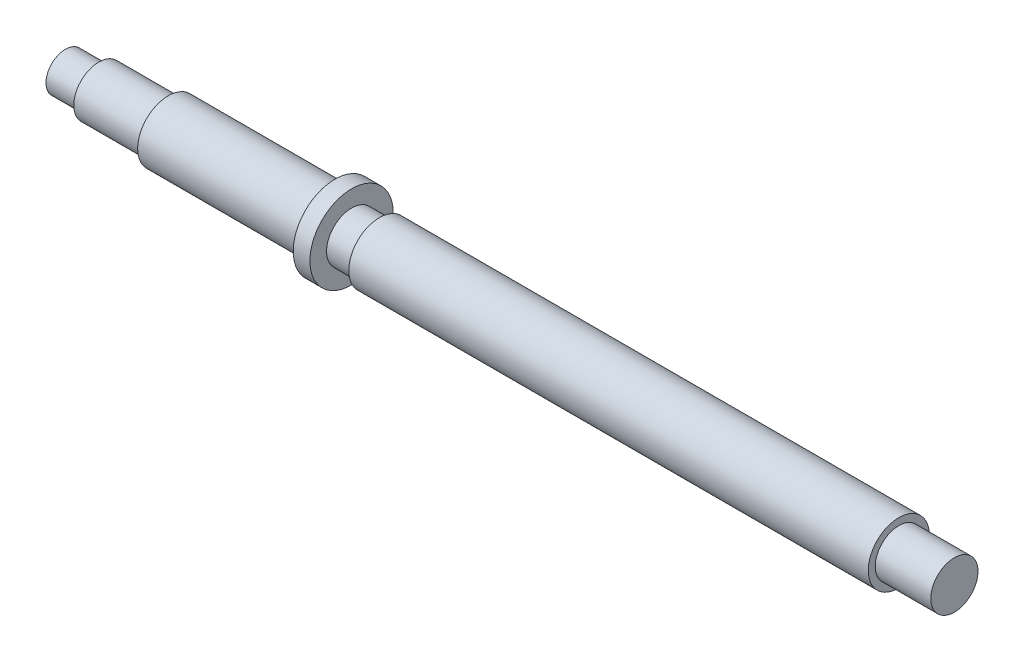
ISO-10303-21;
HEADER;
FILE_DESCRIPTION(('STEP AP214'),'2;1');
FILE_NAME('part.step','',(''),(''),'','','');
FILE_SCHEMA(('AUTOMOTIVE_DESIGN { 1 0 10303 214 1 1 1 1 }'));
ENDSEC;
DATA;
#1=APPLICATION_CONTEXT('core data for automotive mechanical design processes');
#2=APPLICATION_PROTOCOL_DEFINITION('international standard','automotive_design',2000,#1);
#3=PRODUCT_CONTEXT('',#1,'mechanical');
#4=PRODUCT('Part','Part','',(#3));
#5=PRODUCT_RELATED_PRODUCT_CATEGORY('part','',(#4));
#6=PRODUCT_DEFINITION_FORMATION('','',#4);
#7=PRODUCT_DEFINITION_CONTEXT('part definition',#1,'design');
#8=PRODUCT_DEFINITION('design','',#6,#7);
#9=PRODUCT_DEFINITION_SHAPE('','',#8);
#10=(LENGTH_UNIT() NAMED_UNIT(*) SI_UNIT(.MILLI.,.METRE.));
#11=(NAMED_UNIT(*) PLANE_ANGLE_UNIT() SI_UNIT($,.RADIAN.));
#12=(NAMED_UNIT(*) SI_UNIT($,.STERADIAN.) SOLID_ANGLE_UNIT());
#13=UNCERTAINTY_MEASURE_WITH_UNIT(LENGTH_MEASURE(1.E-05),#10,'distance_accuracy_value','');
#14=(GEOMETRIC_REPRESENTATION_CONTEXT(3) GLOBAL_UNCERTAINTY_ASSIGNED_CONTEXT((#13)) GLOBAL_UNIT_ASSIGNED_CONTEXT((#10,
#11,#12)) REPRESENTATION_CONTEXT('',''));
#15=CARTESIAN_POINT('',(0.,0.,0.));
#16=DIRECTION('',(0.,0.,1.));
#17=DIRECTION('',(1.,0.,0.));
#18=AXIS2_PLACEMENT_3D('',#15,#16,#17);
#19=CARTESIAN_POINT('',(0.,3.49999999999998,0.));
#20=DIRECTION('',(1.,0.,0.));
#21=DIRECTION('',(0.,1.,0.));
#22=AXIS2_PLACEMENT_3D('',#19,#20,#21);
#23=PLANE('',#22);
#24=CARTESIAN_POINT('',(0.,0.,0.));
#25=DIRECTION('',(-1.,0.,0.));
#26=DIRECTION('',(0.,-1.,0.));
#27=AXIS2_PLACEMENT_3D('',#24,#25,#26);
#28=CIRCLE('',#27,3.5);
#29=CARTESIAN_POINT('',(0.,-3.50000000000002,0.));
#30=VERTEX_POINT('',#29);
#31=EDGE_CURVE('E76',#30,#30,#28,.T.);
#32=ORIENTED_EDGE('',*,*,#31,.T.);
#33=EDGE_LOOP('',(#32));
#34=FACE_BOUND('',#33,.T.);
#35=ADVANCED_FACE('F30',(#34),#23,.F.);
#36=CARTESIAN_POINT('',(160.,0.,0.));
#37=DIRECTION('',(-1.,0.,0.));
#38=DIRECTION('',(0.,-1.,0.));
#39=AXIS2_PLACEMENT_3D('',#36,#37,#38);
#40=PLANE('',#39);
#41=CARTESIAN_POINT('',(160.,0.,0.));
#42=DIRECTION('',(-1.,0.,0.));
#43=DIRECTION('',(0.,-1.,0.));
#44=AXIS2_PLACEMENT_3D('',#41,#42,#43);
#45=CIRCLE('',#44,4.25);
#46=CARTESIAN_POINT('',(160.,-4.25,0.));
#47=VERTEX_POINT('',#46);
#48=EDGE_CURVE('E10',#47,#47,#45,.T.);
#49=ORIENTED_EDGE('',*,*,#48,.F.);
#50=EDGE_LOOP('',(#49));
#51=FACE_BOUND('',#50,.T.);
#52=ADVANCED_FACE('F154',(#51),#40,.F.);
#53=CARTESIAN_POINT('',(160.,0.,0.));
#54=DIRECTION('',(-1.,0.,0.));
#55=DIRECTION('',(0.,-1.,0.));
#56=AXIS2_PLACEMENT_3D('',#53,#54,#55);
#57=CYLINDRICAL_SURFACE('',#56,4.25);
#58=CARTESIAN_POINT('',(150.,0.,0.));
#59=DIRECTION('',(-1.,0.,0.));
#60=DIRECTION('',(0.,-1.,0.));
#61=AXIS2_PLACEMENT_3D('',#58,#59,#60);
#62=CIRCLE('',#61,4.25);
#63=CARTESIAN_POINT('',(150.,-4.25,0.));
#64=VERTEX_POINT('',#63);
#65=EDGE_CURVE('E36',#64,#64,#62,.T.);
#66=ORIENTED_EDGE('',*,*,#65,.F.);
#67=EDGE_LOOP('',(#66));
#68=FACE_BOUND('',#67,.T.);
#69=ORIENTED_EDGE('',*,*,#48,.T.);
#70=EDGE_LOOP('',(#69));
#71=FACE_BOUND('',#70,.T.);
#72=ADVANCED_FACE('F149',(#68,#71),#57,.T.);
#73=CARTESIAN_POINT('',(150.,4.25,0.));
#74=DIRECTION('',(-1.,0.,0.));
#75=DIRECTION('',(0.,-1.,0.));
#76=AXIS2_PLACEMENT_3D('',#73,#74,#75);
#77=PLANE('',#76);
#78=CARTESIAN_POINT('',(150.,0.,0.));
#79=DIRECTION('',(-1.,0.,0.));
#80=DIRECTION('',(0.,-1.,0.));
#81=AXIS2_PLACEMENT_3D('',#78,#79,#80);
#82=CIRCLE('',#81,5.5);
#83=CARTESIAN_POINT('',(150.,-5.5,0.));
#84=VERTEX_POINT('',#83);
#85=EDGE_CURVE('E40',#84,#84,#82,.T.);
#86=ORIENTED_EDGE('',*,*,#85,.F.);
#87=EDGE_LOOP('',(#86));
#88=FACE_BOUND('',#87,.T.);
#89=ORIENTED_EDGE('',*,*,#65,.T.);
#90=EDGE_LOOP('',(#89));
#91=FACE_BOUND('',#90,.T.);
#92=ADVANCED_FACE('F144',(#88,#91),#77,.F.);
#93=CARTESIAN_POINT('',(160.,0.,0.));
#94=DIRECTION('',(-1.,0.,0.));
#95=DIRECTION('',(0.,-1.,0.));
#96=AXIS2_PLACEMENT_3D('',#93,#94,#95);
#97=CYLINDRICAL_SURFACE('',#96,5.5);
#98=CARTESIAN_POINT('',(56.5,0.,0.));
#99=DIRECTION('',(-1.,0.,0.));
#100=DIRECTION('',(0.,-1.,0.));
#101=AXIS2_PLACEMENT_3D('',#98,#99,#100);
#102=CIRCLE('',#101,5.5);
#103=CARTESIAN_POINT('',(56.5,-5.50000000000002,0.));
#104=VERTEX_POINT('',#103);
#105=EDGE_CURVE('E44',#104,#104,#102,.T.);
#106=ORIENTED_EDGE('',*,*,#105,.F.);
#107=EDGE_LOOP('',(#106));
#108=FACE_BOUND('',#107,.T.);
#109=ORIENTED_EDGE('',*,*,#85,.T.);
#110=EDGE_LOOP('',(#109));
#111=FACE_BOUND('',#110,.T.);
#112=ADVANCED_FACE('F138',(#108,#111),#97,.T.);
#113=CARTESIAN_POINT('',(56.5,4.5,0.));
#114=DIRECTION('',(1.,0.,0.));
#115=DIRECTION('',(0.,1.,0.));
#116=AXIS2_PLACEMENT_3D('',#113,#114,#115);
#117=PLANE('',#116);
#118=CARTESIAN_POINT('',(56.5,0.,0.));
#119=DIRECTION('',(-1.,0.,0.));
#120=DIRECTION('',(0.,-1.,0.));
#121=AXIS2_PLACEMENT_3D('',#118,#119,#120);
#122=CIRCLE('',#121,4.50000000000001);
#123=CARTESIAN_POINT('',(56.5,-4.50000000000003,0.));
#124=VERTEX_POINT('',#123);
#125=EDGE_CURVE('E49',#124,#124,#122,.T.);
#126=ORIENTED_EDGE('',*,*,#125,.F.);
#127=EDGE_LOOP('',(#126));
#128=FACE_BOUND('',#127,.T.);
#129=ORIENTED_EDGE('',*,*,#105,.T.);
#130=EDGE_LOOP('',(#129));
#131=FACE_BOUND('',#130,.T.);
#132=ADVANCED_FACE('F132',(#128,#131),#117,.F.);
#133=CARTESIAN_POINT('',(160.,0.,0.));
#134=DIRECTION('',(-1.,0.,0.));
#135=DIRECTION('',(0.,-1.,0.));
#136=AXIS2_PLACEMENT_3D('',#133,#134,#135);
#137=CYLINDRICAL_SURFACE('',#136,4.50000000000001);
#138=CARTESIAN_POINT('',(51.5,0.,0.));
#139=DIRECTION('',(-1.,0.,0.));
#140=DIRECTION('',(0.,-1.,0.));
#141=AXIS2_PLACEMENT_3D('',#138,#139,#140);
#142=CIRCLE('',#141,4.50000000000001);
#143=CARTESIAN_POINT('',(51.5,-4.50000000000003,0.));
#144=VERTEX_POINT('',#143);
#145=EDGE_CURVE('E52',#144,#144,#142,.T.);
#146=ORIENTED_EDGE('',*,*,#145,.F.);
#147=EDGE_LOOP('',(#146));
#148=FACE_BOUND('',#147,.T.);
#149=ORIENTED_EDGE('',*,*,#125,.T.);
#150=EDGE_LOOP('',(#149));
#151=FACE_BOUND('',#150,.T.);
#152=ADVANCED_FACE('F126',(#148,#151),#137,.T.);
#153=CARTESIAN_POINT('',(51.5,7.5,0.));
#154=DIRECTION('',(-1.,0.,0.));
#155=DIRECTION('',(0.,-1.,0.));
#156=AXIS2_PLACEMENT_3D('',#153,#154,#155);
#157=PLANE('',#156);
#158=CARTESIAN_POINT('',(51.5,0.,0.));
#159=DIRECTION('',(-1.,0.,0.));
#160=DIRECTION('',(0.,-1.,0.));
#161=AXIS2_PLACEMENT_3D('',#158,#159,#160);
#162=CIRCLE('',#161,7.50000000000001);
#163=CARTESIAN_POINT('',(51.5,-7.50000000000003,0.));
#164=VERTEX_POINT('',#163);
#165=EDGE_CURVE('E55',#164,#164,#162,.T.);
#166=ORIENTED_EDGE('',*,*,#165,.F.);
#167=EDGE_LOOP('',(#166));
#168=FACE_BOUND('',#167,.T.);
#169=ORIENTED_EDGE('',*,*,#145,.T.);
#170=EDGE_LOOP('',(#169));
#171=FACE_BOUND('',#170,.T.);
#172=ADVANCED_FACE('F120',(#168,#171),#157,.F.);
#173=CARTESIAN_POINT('',(160.,0.,0.));
#174=DIRECTION('',(-1.,0.,0.));
#175=DIRECTION('',(0.,-1.,0.));
#176=AXIS2_PLACEMENT_3D('',#173,#174,#175);
#177=CYLINDRICAL_SURFACE('',#176,7.50000000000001);
#178=CARTESIAN_POINT('',(48.5,0.,0.));
#179=DIRECTION('',(-1.,0.,0.));
#180=DIRECTION('',(0.,-1.,0.));
#181=AXIS2_PLACEMENT_3D('',#178,#179,#180);
#182=CIRCLE('',#181,7.50000000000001);
#183=CARTESIAN_POINT('',(48.5,-7.50000000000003,0.));
#184=VERTEX_POINT('',#183);
#185=EDGE_CURVE('E58',#184,#184,#182,.T.);
#186=ORIENTED_EDGE('',*,*,#185,.F.);
#187=EDGE_LOOP('',(#186));
#188=FACE_BOUND('',#187,.T.);
#189=ORIENTED_EDGE('',*,*,#165,.T.);
#190=EDGE_LOOP('',(#189));
#191=FACE_BOUND('',#190,.T.);
#192=ADVANCED_FACE('F114',(#188,#191),#177,.T.);
#193=CARTESIAN_POINT('',(48.5,5.5,0.));
#194=DIRECTION('',(1.,0.,0.));
#195=DIRECTION('',(0.,1.,0.));
#196=AXIS2_PLACEMENT_3D('',#193,#194,#195);
#197=PLANE('',#196);
#198=CARTESIAN_POINT('',(48.5,0.,0.));
#199=DIRECTION('',(-1.,0.,0.));
#200=DIRECTION('',(0.,-1.,0.));
#201=AXIS2_PLACEMENT_3D('',#198,#199,#200);
#202=CIRCLE('',#201,5.50000000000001);
#203=CARTESIAN_POINT('',(48.5,-5.50000000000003,0.));
#204=VERTEX_POINT('',#203);
#205=EDGE_CURVE('E61',#204,#204,#202,.T.);
#206=ORIENTED_EDGE('',*,*,#205,.F.);
#207=EDGE_LOOP('',(#206));
#208=FACE_BOUND('',#207,.T.);
#209=ORIENTED_EDGE('',*,*,#185,.T.);
#210=EDGE_LOOP('',(#209));
#211=FACE_BOUND('',#210,.T.);
#212=ADVANCED_FACE('F108',(#208,#211),#197,.F.);
#213=CARTESIAN_POINT('',(160.,0.,0.));
#214=DIRECTION('',(-1.,0.,0.));
#215=DIRECTION('',(0.,-1.,0.));
#216=AXIS2_PLACEMENT_3D('',#213,#214,#215);
#217=CYLINDRICAL_SURFACE('',#216,5.50000000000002);
#218=CARTESIAN_POINT('',(18.5,0.,0.));
#219=DIRECTION('',(-1.,0.,0.));
#220=DIRECTION('',(0.,-1.,0.));
#221=AXIS2_PLACEMENT_3D('',#218,#219,#220);
#222=CIRCLE('',#221,5.50000000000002);
#223=CARTESIAN_POINT('',(18.5,-5.50000000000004,0.));
#224=VERTEX_POINT('',#223);
#225=EDGE_CURVE('E64',#224,#224,#222,.T.);
#226=ORIENTED_EDGE('',*,*,#225,.F.);
#227=EDGE_LOOP('',(#226));
#228=FACE_BOUND('',#227,.T.);
#229=ORIENTED_EDGE('',*,*,#205,.T.);
#230=EDGE_LOOP('',(#229));
#231=FACE_BOUND('',#230,.T.);
#232=ADVANCED_FACE('F102',(#228,#231),#217,.T.);
#233=CARTESIAN_POINT('',(18.5,4.49999999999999,0.));
#234=DIRECTION('',(1.,0.,0.));
#235=DIRECTION('',(0.,1.,0.));
#236=AXIS2_PLACEMENT_3D('',#233,#234,#235);
#237=PLANE('',#236);
#238=CARTESIAN_POINT('',(18.5,0.,0.));
#239=DIRECTION('',(-1.,0.,0.));
#240=DIRECTION('',(0.,-1.,0.));
#241=AXIS2_PLACEMENT_3D('',#238,#239,#240);
#242=CIRCLE('',#241,4.50000000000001);
#243=CARTESIAN_POINT('',(18.5,-4.50000000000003,0.));
#244=VERTEX_POINT('',#243);
#245=EDGE_CURVE('E67',#244,#244,#242,.T.);
#246=ORIENTED_EDGE('',*,*,#245,.F.);
#247=EDGE_LOOP('',(#246));
#248=FACE_BOUND('',#247,.T.);
#249=ORIENTED_EDGE('',*,*,#225,.T.);
#250=EDGE_LOOP('',(#249));
#251=FACE_BOUND('',#250,.T.);
#252=ADVANCED_FACE('F96',(#248,#251),#237,.F.);
#253=CARTESIAN_POINT('',(160.,0.,0.));
#254=DIRECTION('',(-1.,0.,0.));
#255=DIRECTION('',(0.,-1.,0.));
#256=AXIS2_PLACEMENT_3D('',#253,#254,#255);
#257=CYLINDRICAL_SURFACE('',#256,4.50000000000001);
#258=CARTESIAN_POINT('',(6.00000000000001,0.,0.));
#259=DIRECTION('',(-1.,0.,0.));
#260=DIRECTION('',(0.,-1.,0.));
#261=AXIS2_PLACEMENT_3D('',#258,#259,#260);
#262=CIRCLE('',#261,4.50000000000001);
#263=CARTESIAN_POINT('',(6.00000000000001,-4.50000000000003,0.));
#264=VERTEX_POINT('',#263);
#265=EDGE_CURVE('E70',#264,#264,#262,.T.);
#266=ORIENTED_EDGE('',*,*,#265,.F.);
#267=EDGE_LOOP('',(#266));
#268=FACE_BOUND('',#267,.T.);
#269=ORIENTED_EDGE('',*,*,#245,.T.);
#270=EDGE_LOOP('',(#269));
#271=FACE_BOUND('',#270,.T.);
#272=ADVANCED_FACE('F90',(#268,#271),#257,.T.);
#273=CARTESIAN_POINT('',(6.,4.49999999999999,0.));
#274=DIRECTION('',(1.,0.,0.));
#275=DIRECTION('',(0.,1.,0.));
#276=AXIS2_PLACEMENT_3D('',#273,#274,#275);
#277=PLANE('',#276);
#278=CARTESIAN_POINT('',(6.00000000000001,0.,0.));
#279=DIRECTION('',(-1.,0.,0.));
#280=DIRECTION('',(0.,-1.,0.));
#281=AXIS2_PLACEMENT_3D('',#278,#279,#280);
#282=CIRCLE('',#281,3.5);
#283=CARTESIAN_POINT('',(6.00000000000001,-3.50000000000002,0.));
#284=VERTEX_POINT('',#283);
#285=EDGE_CURVE('E73',#284,#284,#282,.T.);
#286=ORIENTED_EDGE('',*,*,#285,.F.);
#287=EDGE_LOOP('',(#286));
#288=FACE_BOUND('',#287,.T.);
#289=ORIENTED_EDGE('',*,*,#265,.T.);
#290=EDGE_LOOP('',(#289));
#291=FACE_BOUND('',#290,.T.);
#292=ADVANCED_FACE('F84',(#288,#291),#277,.F.);
#293=CARTESIAN_POINT('',(160.,0.,0.));
#294=DIRECTION('',(-1.,0.,0.));
#295=DIRECTION('',(0.,-1.,0.));
#296=AXIS2_PLACEMENT_3D('',#293,#294,#295);
#297=CYLINDRICAL_SURFACE('',#296,3.5);
#298=ORIENTED_EDGE('',*,*,#31,.F.);
#299=EDGE_LOOP('',(#298));
#300=FACE_BOUND('',#299,.T.);
#301=ORIENTED_EDGE('',*,*,#285,.T.);
#302=EDGE_LOOP('',(#301));
#303=FACE_BOUND('',#302,.T.);
#304=ADVANCED_FACE('F81',(#300,#303),#297,.T.);
#305=CLOSED_SHELL('',(#35,#52,#72,#92,#112,#132,#152,#172,#192,#212,#232,#252,#272,#292,#304));
#306=MANIFOLD_SOLID_BREP('B2',#305);
#307=ADVANCED_BREP_SHAPE_REPRESENTATION('',(#18,#306),#14);
#308=SHAPE_DEFINITION_REPRESENTATION(#9,#307);
ENDSEC;
END-ISO-10303-21;
